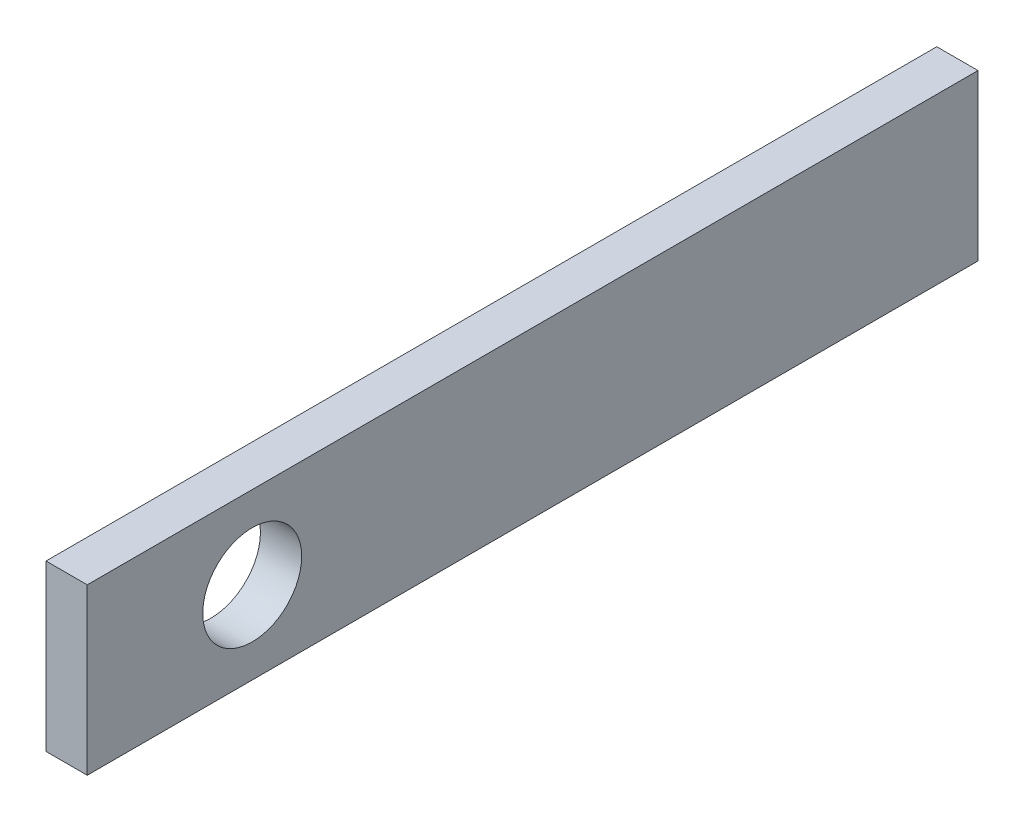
from build123d import *

# Parameters (mm, degrees)
SKETCH1_W           = 68.58
SKETCH1_H           = 12.7
SKETCH1_R           = 3.81
BOSS_EXTRUDE1_DEPTH = 3.175


with BuildPart() as part:
    # Sketch1 → Boss-Extrude1 (new body)
    with BuildSketch(Plane(origin=(0, 0, 0), x_dir=(0, 0, -1), z_dir=(1, 0, 0))):
        with Locations((34.29, 6.35)):
            Rectangle(SKETCH1_W, SKETCH1_H)
        with Locations((12.7, 6.35)):
            Circle(SKETCH1_R, mode=Mode.SUBTRACT)
    extrude(amount=BOSS_EXTRUDE1_DEPTH)


solid = part.part
